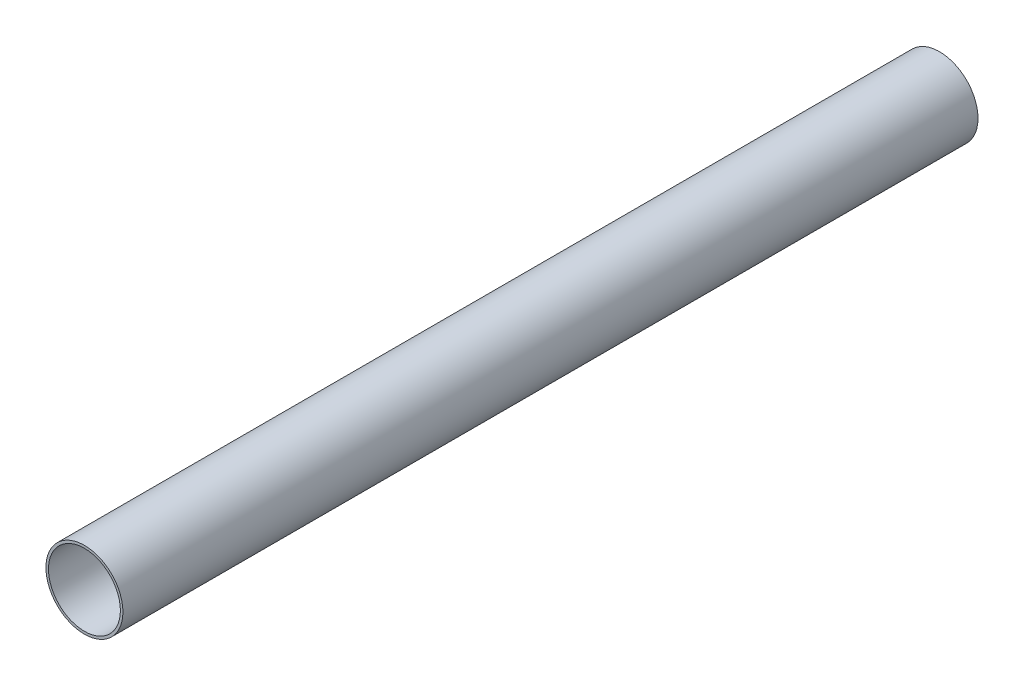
ISO-10303-21;
HEADER;
FILE_DESCRIPTION(('STEP AP214'),'2;1');
FILE_NAME('part.step','',(''),(''),'','','');
FILE_SCHEMA(('AUTOMOTIVE_DESIGN { 1 0 10303 214 1 1 1 1 }'));
ENDSEC;
DATA;
#1=APPLICATION_CONTEXT('core data for automotive mechanical design processes');
#2=APPLICATION_PROTOCOL_DEFINITION('international standard','automotive_design',2000,#1);
#3=PRODUCT_CONTEXT('',#1,'mechanical');
#4=PRODUCT('Part','Part','',(#3));
#5=PRODUCT_RELATED_PRODUCT_CATEGORY('part','',(#4));
#6=PRODUCT_DEFINITION_FORMATION('','',#4);
#7=PRODUCT_DEFINITION_CONTEXT('part definition',#1,'design');
#8=PRODUCT_DEFINITION('design','',#6,#7);
#9=PRODUCT_DEFINITION_SHAPE('','',#8);
#10=(LENGTH_UNIT() NAMED_UNIT(*) SI_UNIT(.MILLI.,.METRE.));
#11=(NAMED_UNIT(*) PLANE_ANGLE_UNIT() SI_UNIT($,.RADIAN.));
#12=(NAMED_UNIT(*) SI_UNIT($,.STERADIAN.) SOLID_ANGLE_UNIT());
#13=UNCERTAINTY_MEASURE_WITH_UNIT(LENGTH_MEASURE(1.E-05),#10,'distance_accuracy_value','');
#14=(GEOMETRIC_REPRESENTATION_CONTEXT(3) GLOBAL_UNCERTAINTY_ASSIGNED_CONTEXT((#13)) GLOBAL_UNIT_ASSIGNED_CONTEXT((#10,
#11,#12)) REPRESENTATION_CONTEXT('',''));
#15=CARTESIAN_POINT('',(0.,0.,0.));
#16=DIRECTION('',(0.,0.,1.));
#17=DIRECTION('',(1.,0.,0.));
#18=AXIS2_PLACEMENT_3D('',#15,#16,#17);
#19=CARTESIAN_POINT('',(0.,0.,599.44));
#20=DIRECTION('',(0.,0.,1.));
#21=DIRECTION('',(1.,0.,0.));
#22=AXIS2_PLACEMENT_3D('',#19,#20,#21);
#23=PLANE('',#22);
#24=CARTESIAN_POINT('',(0.,0.,599.44));
#25=DIRECTION('',(0.,0.,1.));
#26=DIRECTION('',(1.,0.,0.));
#27=AXIS2_PLACEMENT_3D('',#24,#25,#26);
#28=CIRCLE('',#27,26.9875);
#29=CARTESIAN_POINT('',(26.9875,0.,599.44));
#30=VERTEX_POINT('',#29);
#31=EDGE_CURVE('E10',#30,#30,#28,.T.);
#32=ORIENTED_EDGE('',*,*,#31,.T.);
#33=EDGE_LOOP('',(#32));
#34=FACE_BOUND('',#33,.T.);
#35=CARTESIAN_POINT('',(0.,0.,599.44));
#36=DIRECTION('',(0.,0.,1.));
#37=DIRECTION('',(1.,0.,0.));
#38=AXIS2_PLACEMENT_3D('',#35,#36,#37);
#39=CIRCLE('',#38,25.2095);
#40=CARTESIAN_POINT('',(25.2095,0.,599.44));
#41=VERTEX_POINT('',#40);
#42=EDGE_CURVE('E50',#41,#41,#39,.T.);
#43=ORIENTED_EDGE('',*,*,#42,.F.);
#44=EDGE_LOOP('',(#43));
#45=FACE_BOUND('',#44,.T.);
#46=ADVANCED_FACE('F37',(#34,#45),#23,.T.);
#47=CARTESIAN_POINT('',(0.,0.,0.));
#48=DIRECTION('',(0.,0.,1.));
#49=DIRECTION('',(1.,0.,0.));
#50=AXIS2_PLACEMENT_3D('',#47,#48,#49);
#51=PLANE('',#50);
#52=CARTESIAN_POINT('',(0.,0.,0.));
#53=DIRECTION('',(0.,0.,1.));
#54=DIRECTION('',(1.,0.,0.));
#55=AXIS2_PLACEMENT_3D('',#52,#53,#54);
#56=CIRCLE('',#55,26.9875);
#57=CARTESIAN_POINT('',(26.9875,0.,0.));
#58=VERTEX_POINT('',#57);
#59=EDGE_CURVE('E41',#58,#58,#56,.T.);
#60=ORIENTED_EDGE('',*,*,#59,.F.);
#61=EDGE_LOOP('',(#60));
#62=FACE_BOUND('',#61,.T.);
#63=CARTESIAN_POINT('',(0.,0.,0.));
#64=DIRECTION('',(0.,0.,1.));
#65=DIRECTION('',(1.,0.,0.));
#66=AXIS2_PLACEMENT_3D('',#63,#64,#65);
#67=CIRCLE('',#66,25.2095);
#68=CARTESIAN_POINT('',(25.2095,0.,0.));
#69=VERTEX_POINT('',#68);
#70=EDGE_CURVE('E52',#69,#69,#67,.T.);
#71=ORIENTED_EDGE('',*,*,#70,.T.);
#72=EDGE_LOOP('',(#71));
#73=FACE_BOUND('',#72,.T.);
#74=ADVANCED_FACE('F64',(#62,#73),#51,.F.);
#75=CARTESIAN_POINT('',(0.,0.,599.44));
#76=DIRECTION('',(0.,0.,-1.));
#77=DIRECTION('',(-1.,0.,0.));
#78=AXIS2_PLACEMENT_3D('',#75,#76,#77);
#79=CYLINDRICAL_SURFACE('',#78,26.9875);
#80=ORIENTED_EDGE('',*,*,#31,.F.);
#81=EDGE_LOOP('',(#80));
#82=FACE_BOUND('',#81,.T.);
#83=ORIENTED_EDGE('',*,*,#59,.T.);
#84=EDGE_LOOP('',(#83));
#85=FACE_BOUND('',#84,.T.);
#86=ADVANCED_FACE('F39',(#82,#85),#79,.T.);
#87=CARTESIAN_POINT('',(0.,0.,599.44));
#88=DIRECTION('',(0.,0.,-1.));
#89=DIRECTION('',(-1.,0.,0.));
#90=AXIS2_PLACEMENT_3D('',#87,#88,#89);
#91=CYLINDRICAL_SURFACE('',#90,25.2095);
#92=ORIENTED_EDGE('',*,*,#42,.T.);
#93=EDGE_LOOP('',(#92));
#94=FACE_BOUND('',#93,.T.);
#95=ORIENTED_EDGE('',*,*,#70,.F.);
#96=EDGE_LOOP('',(#95));
#97=FACE_BOUND('',#96,.T.);
#98=ADVANCED_FACE('F60',(#94,#97),#91,.F.);
#99=CLOSED_SHELL('',(#46,#74,#86,#98));
#100=MANIFOLD_SOLID_BREP('B2',#99);
#101=ADVANCED_BREP_SHAPE_REPRESENTATION('',(#18,#100),#14);
#102=SHAPE_DEFINITION_REPRESENTATION(#9,#101);
ENDSEC;
END-ISO-10303-21;
